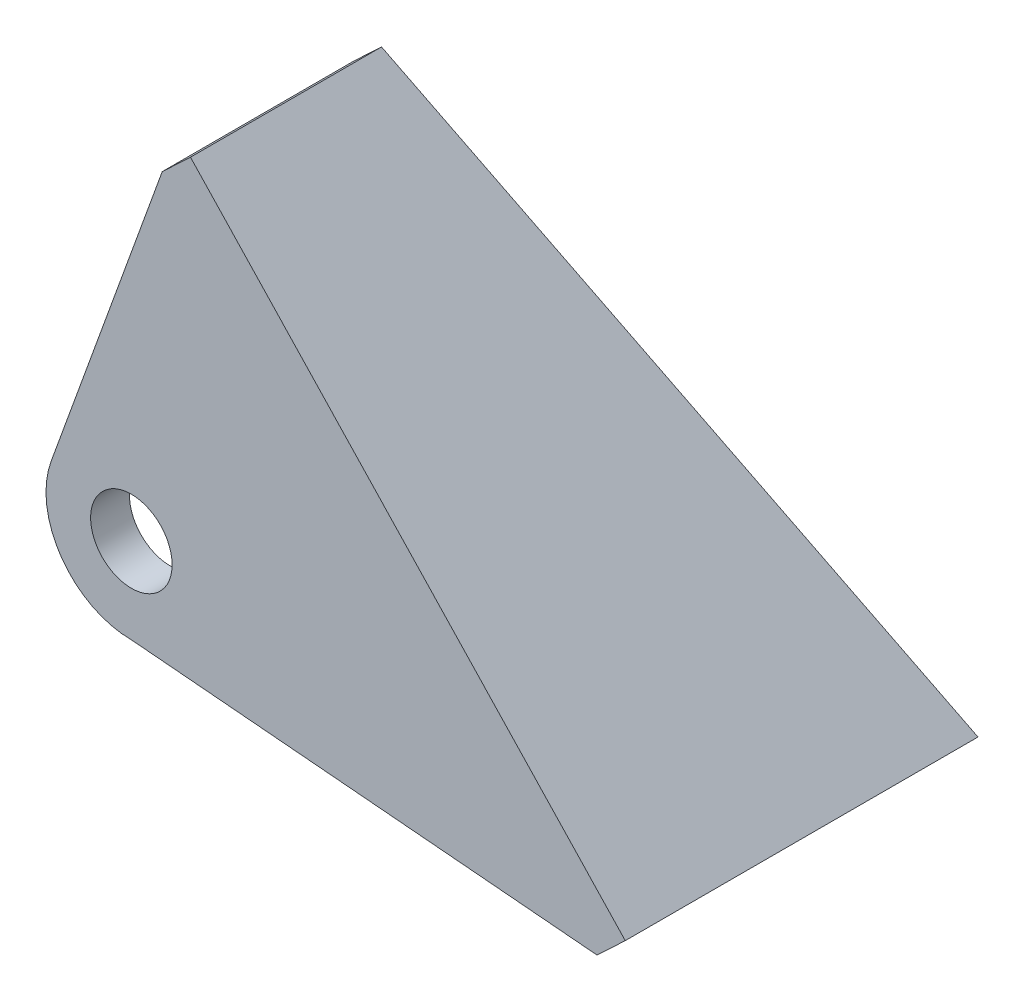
ISO-10303-21;
HEADER;
FILE_DESCRIPTION(('STEP AP214'),'2;1');
FILE_NAME('part.step','',(''),(''),'','','');
FILE_SCHEMA(('AUTOMOTIVE_DESIGN { 1 0 10303 214 1 1 1 1 }'));
ENDSEC;
DATA;
#1=APPLICATION_CONTEXT('core data for automotive mechanical design processes');
#2=APPLICATION_PROTOCOL_DEFINITION('international standard','automotive_design',2000,#1);
#3=PRODUCT_CONTEXT('',#1,'mechanical');
#4=PRODUCT('Part','Part','',(#3));
#5=PRODUCT_RELATED_PRODUCT_CATEGORY('part','',(#4));
#6=PRODUCT_DEFINITION_FORMATION('','',#4);
#7=PRODUCT_DEFINITION_CONTEXT('part definition',#1,'design');
#8=PRODUCT_DEFINITION('design','',#6,#7);
#9=PRODUCT_DEFINITION_SHAPE('','',#8);
#10=(LENGTH_UNIT() NAMED_UNIT(*) SI_UNIT(.MILLI.,.METRE.));
#11=(NAMED_UNIT(*) PLANE_ANGLE_UNIT() SI_UNIT($,.RADIAN.));
#12=(NAMED_UNIT(*) SI_UNIT($,.STERADIAN.) SOLID_ANGLE_UNIT());
#13=UNCERTAINTY_MEASURE_WITH_UNIT(LENGTH_MEASURE(1.E-05),#10,'distance_accuracy_value','');
#14=(GEOMETRIC_REPRESENTATION_CONTEXT(3) GLOBAL_UNCERTAINTY_ASSIGNED_CONTEXT((#13)) GLOBAL_UNIT_ASSIGNED_CONTEXT((#10,
#11,#12)) REPRESENTATION_CONTEXT('',''));
#15=CARTESIAN_POINT('',(0.,0.,0.));
#16=DIRECTION('',(0.,0.,1.));
#17=DIRECTION('',(1.,0.,0.));
#18=AXIS2_PLACEMENT_3D('',#15,#16,#17);
#19=CARTESIAN_POINT('',(-15.,-10.,-15.0000000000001));
#20=DIRECTION('',(0.,0.,1.));
#21=DIRECTION('',(1.,0.,0.));
#22=AXIS2_PLACEMENT_3D('',#19,#20,#21);
#23=PLANE('',#22);
#24=CARTESIAN_POINT('',(-15.,-10.,-15.0000000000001));
#25=DIRECTION('',(0.,0.,1.));
#26=DIRECTION('',(1.,0.,0.));
#27=AXIS2_PLACEMENT_3D('',#24,#25,#26);
#28=CIRCLE('',#27,11.);
#29=CARTESIAN_POINT('',(-25.3409426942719,-6.24967945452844,-15.0000000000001));
#30=VERTEX_POINT('',#29);
#31=CARTESIAN_POINT('',(-15.,-21.,-15.0000000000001));
#32=VERTEX_POINT('',#31);
#33=EDGE_CURVE('E78',#30,#32,#28,.T.);
#34=ORIENTED_EDGE('',*,*,#33,.T.);
#35=DIRECTION('',(0.996294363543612,-0.086008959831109,0.));
#36=VECTOR('',#35,1.);
#37=CARTESIAN_POINT('',(-15.,-21.,-15.0000000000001));
#38=LINE('',#37,#36);
#39=CARTESIAN_POINT('',(45.0000000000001,-26.1797317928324,-15.0000000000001));
#40=VERTEX_POINT('',#39);
#41=EDGE_CURVE('E142',#32,#40,#38,.T.);
#42=ORIENTED_EDGE('',*,*,#41,.T.);
#43=DIRECTION('',(-0.727571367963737,-0.686031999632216,0.));
#44=VECTOR('',#43,1.);
#45=CARTESIAN_POINT('',(48.6378568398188,-22.7495717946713,-15.0000000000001));
#46=LINE('',#45,#44);
#47=CARTESIAN_POINT('',(48.6378568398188,-22.7495717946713,-15.0000000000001));
#48=VERTEX_POINT('',#47);
#49=EDGE_CURVE('E114',#48,#40,#46,.T.);
#50=ORIENTED_EDGE('',*,*,#49,.F.);
#51=DIRECTION('',(0.686031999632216,-0.727571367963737,0.));
#52=VECTOR('',#51,1.);
#53=CARTESIAN_POINT('',(-7.38368013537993,36.6640799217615,-15.0000000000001));
#54=LINE('',#53,#52);
#55=CARTESIAN_POINT('',(-7.38368013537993,36.6640799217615,-15.0000000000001));
#56=VERTEX_POINT('',#55);
#57=EDGE_CURVE('E132',#56,#48,#54,.T.);
#58=ORIENTED_EDGE('',*,*,#57,.F.);
#59=DIRECTION('',(-0.727571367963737,-0.686031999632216,0.));
#60=VECTOR('',#59,1.);
#61=CARTESIAN_POINT('',(-7.38368013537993,36.6640799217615,-15.0000000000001));
#62=LINE('',#61,#60);
#63=CARTESIAN_POINT('',(-11.0215369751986,33.2339199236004,-15.0000000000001));
#64=VERTEX_POINT('',#63);
#65=EDGE_CURVE('E133',#56,#64,#62,.T.);
#66=ORIENTED_EDGE('',*,*,#65,.T.);
#67=DIRECTION('',(-0.340938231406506,-0.940085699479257,0.));
#68=VECTOR('',#67,1.);
#69=CARTESIAN_POINT('',(-25.3409426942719,-6.24967945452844,-15.0000000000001));
#70=LINE('',#69,#68);
#71=EDGE_CURVE('E48',#64,#30,#70,.T.);
#72=ORIENTED_EDGE('',*,*,#71,.T.);
#73=EDGE_LOOP('',(#34,#42,#50,#58,#66,#72));
#74=FACE_BOUND('',#73,.T.);
#75=CARTESIAN_POINT('',(-15.,-10.,-15.0000000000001));
#76=DIRECTION('',(0.,0.,1.));
#77=DIRECTION('',(1.,0.,0.));
#78=AXIS2_PLACEMENT_3D('',#75,#76,#77);
#79=CIRCLE('',#78,5.25);
#80=CARTESIAN_POINT('',(-9.75000000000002,-10.,-15.0000000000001));
#81=VERTEX_POINT('',#80);
#82=EDGE_CURVE('E90',#81,#81,#79,.T.);
#83=ORIENTED_EDGE('',*,*,#82,.F.);
#84=EDGE_LOOP('',(#83));
#85=FACE_BOUND('',#84,.T.);
#86=ADVANCED_FACE('F31',(#74,#85),#23,.T.);
#87=CARTESIAN_POINT('',(-15.,-10.,-20.0000000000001));
#88=DIRECTION('',(0.,0.,1.));
#89=DIRECTION('',(1.,0.,0.));
#90=AXIS2_PLACEMENT_3D('',#87,#88,#89);
#91=PLANE('',#90);
#92=CARTESIAN_POINT('',(-15.,-10.,-20.0000000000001));
#93=DIRECTION('',(0.,0.,1.));
#94=DIRECTION('',(1.,0.,0.));
#95=AXIS2_PLACEMENT_3D('',#92,#93,#94);
#96=CIRCLE('',#95,11.);
#97=CARTESIAN_POINT('',(-25.3409426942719,-6.24967945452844,-20.0000000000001));
#98=VERTEX_POINT('',#97);
#99=CARTESIAN_POINT('',(-15.,-21.,-20.0000000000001));
#100=VERTEX_POINT('',#99);
#101=EDGE_CURVE('E84',#98,#100,#96,.T.);
#102=ORIENTED_EDGE('',*,*,#101,.F.);
#103=DIRECTION('',(-0.340938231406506,-0.940085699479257,0.));
#104=VECTOR('',#103,1.);
#105=CARTESIAN_POINT('',(-25.3409426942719,-6.24967945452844,-20.0000000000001));
#106=LINE('',#105,#104);
#107=CARTESIAN_POINT('',(-11.0215369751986,33.2339199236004,-20.0000000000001));
#108=VERTEX_POINT('',#107);
#109=EDGE_CURVE('E69',#108,#98,#106,.T.);
#110=ORIENTED_EDGE('',*,*,#109,.F.);
#111=DIRECTION('',(-0.686031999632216,0.727571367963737,0.));
#112=VECTOR('',#111,1.);
#113=CARTESIAN_POINT('',(-11.0215369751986,33.2339199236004,-20.0000000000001));
#114=LINE('',#113,#112);
#115=CARTESIAN_POINT('',(45.0000000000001,-26.1797317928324,-20.0000000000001));
#116=VERTEX_POINT('',#115);
#117=EDGE_CURVE('E79',#116,#108,#114,.T.);
#118=ORIENTED_EDGE('',*,*,#117,.F.);
#119=DIRECTION('',(0.996294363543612,-0.086008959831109,0.));
#120=VECTOR('',#119,1.);
#121=CARTESIAN_POINT('',(-15.,-21.,-20.0000000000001));
#122=LINE('',#121,#120);
#123=EDGE_CURVE('E89',#100,#116,#122,.T.);
#124=ORIENTED_EDGE('',*,*,#123,.F.);
#125=EDGE_LOOP('',(#102,#110,#118,#124));
#126=FACE_BOUND('',#125,.T.);
#127=CARTESIAN_POINT('',(-15.,-10.,-20.0000000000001));
#128=DIRECTION('',(0.,0.,1.));
#129=DIRECTION('',(1.,0.,0.));
#130=AXIS2_PLACEMENT_3D('',#127,#128,#129);
#131=CIRCLE('',#130,5.25);
#132=CARTESIAN_POINT('',(-9.75000000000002,-10.,-20.0000000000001));
#133=VERTEX_POINT('',#132);
#134=EDGE_CURVE('E94',#133,#133,#131,.T.);
#135=ORIENTED_EDGE('',*,*,#134,.T.);
#136=EDGE_LOOP('',(#135));
#137=FACE_BOUND('',#136,.T.);
#138=ADVANCED_FACE('F86',(#126,#137),#91,.F.);
#139=CARTESIAN_POINT('',(-15.,-10.,-15.0000000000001));
#140=DIRECTION('',(0.,0.,-1.));
#141=DIRECTION('',(-1.,0.,0.));
#142=AXIS2_PLACEMENT_3D('',#139,#140,#141);
#143=CYLINDRICAL_SURFACE('',#142,11.);
#144=ORIENTED_EDGE('',*,*,#101,.T.);
#145=DIRECTION('',(0.,0.,-1.));
#146=VECTOR('',#145,1.);
#147=CARTESIAN_POINT('',(-15.,-21.,-15.0000000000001));
#148=LINE('',#147,#146);
#149=EDGE_CURVE('E11',#32,#100,#148,.T.);
#150=ORIENTED_EDGE('',*,*,#149,.F.);
#151=ORIENTED_EDGE('',*,*,#33,.F.);
#152=DIRECTION('',(0.,0.,-1.));
#153=VECTOR('',#152,1.);
#154=CARTESIAN_POINT('',(-25.3409426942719,-6.24967945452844,-15.0000000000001));
#155=LINE('',#154,#153);
#156=EDGE_CURVE('E72',#30,#98,#155,.T.);
#157=ORIENTED_EDGE('',*,*,#156,.T.);
#158=EDGE_LOOP('',(#144,#150,#151,#157));
#159=FACE_BOUND('',#158,.T.);
#160=ADVANCED_FACE('F33',(#159),#143,.T.);
#161=CARTESIAN_POINT('',(-15.,-21.,-15.0000000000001));
#162=DIRECTION('',(0.086008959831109,0.996294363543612,0.));
#163=DIRECTION('',(-0.996294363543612,0.086008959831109,0.));
#164=AXIS2_PLACEMENT_3D('',#161,#162,#163);
#165=PLANE('',#164);
#166=ORIENTED_EDGE('',*,*,#123,.T.);
#167=DIRECTION('',(0.,0.,-1.));
#168=VECTOR('',#167,1.);
#169=CARTESIAN_POINT('',(45.0000000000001,-26.1797317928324,-15.0000000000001));
#170=LINE('',#169,#168);
#171=EDGE_CURVE('E40',#40,#116,#170,.T.);
#172=ORIENTED_EDGE('',*,*,#171,.F.);
#173=ORIENTED_EDGE('',*,*,#41,.F.);
#174=ORIENTED_EDGE('',*,*,#149,.T.);
#175=EDGE_LOOP('',(#166,#172,#173,#174));
#176=FACE_BOUND('',#175,.T.);
#177=ADVANCED_FACE('F118',(#176),#165,.F.);
#178=CARTESIAN_POINT('',(-25.3409426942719,-6.24967945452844,-15.0000000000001));
#179=DIRECTION('',(0.940085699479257,-0.340938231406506,0.));
#180=DIRECTION('',(0.340938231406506,0.940085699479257,0.));
#181=AXIS2_PLACEMENT_3D('',#178,#179,#180);
#182=PLANE('',#181);
#183=ORIENTED_EDGE('',*,*,#109,.T.);
#184=ORIENTED_EDGE('',*,*,#156,.F.);
#185=ORIENTED_EDGE('',*,*,#71,.F.);
#186=DIRECTION('',(0.,0.,-1.));
#187=VECTOR('',#186,1.);
#188=CARTESIAN_POINT('',(-11.0215369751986,33.2339199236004,-15.0000000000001));
#189=LINE('',#188,#187);
#190=EDGE_CURVE('E74',#64,#108,#189,.T.);
#191=ORIENTED_EDGE('',*,*,#190,.T.);
#192=EDGE_LOOP('',(#183,#184,#185,#191));
#193=FACE_BOUND('',#192,.T.);
#194=ADVANCED_FACE('F71',(#193),#182,.F.);
#195=CARTESIAN_POINT('',(-15.,-10.,-15.0000000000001));
#196=DIRECTION('',(0.,0.,-1.));
#197=DIRECTION('',(-1.,0.,0.));
#198=AXIS2_PLACEMENT_3D('',#195,#196,#197);
#199=CYLINDRICAL_SURFACE('',#198,5.25);
#200=ORIENTED_EDGE('',*,*,#82,.T.);
#201=EDGE_LOOP('',(#200));
#202=FACE_BOUND('',#201,.T.);
#203=ORIENTED_EDGE('',*,*,#134,.F.);
#204=EDGE_LOOP('',(#203));
#205=FACE_BOUND('',#204,.T.);
#206=ADVANCED_FACE('F191',(#202,#205),#199,.F.);
#207=CARTESIAN_POINT('',(45.0000000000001,-26.1797317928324,-15.0000000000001));
#208=DIRECTION('',(0.727571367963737,0.686031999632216,0.));
#209=DIRECTION('',(-0.686031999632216,0.727571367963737,0.));
#210=AXIS2_PLACEMENT_3D('',#207,#208,#209);
#211=PLANE('',#210);
#212=DIRECTION('',(0.,0.,-1.));
#213=VECTOR('',#212,1.);
#214=CARTESIAN_POINT('',(45.0000000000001,-26.1797317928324,-15.0000000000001));
#215=LINE('',#214,#213);
#216=CARTESIAN_POINT('',(45.0000000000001,-26.1797317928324,-60.4479558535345));
#217=VERTEX_POINT('',#216);
#218=EDGE_CURVE('E109',#116,#217,#215,.T.);
#219=ORIENTED_EDGE('',*,*,#218,.F.);
#220=ORIENTED_EDGE('',*,*,#117,.T.);
#221=DIRECTION('',(0.,0.,1.));
#222=VECTOR('',#221,1.);
#223=CARTESIAN_POINT('',(-11.0215369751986,33.2339199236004,-15.0000000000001));
#224=LINE('',#223,#222);
#225=CARTESIAN_POINT('',(-11.0215369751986,33.2339199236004,-39.6116870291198));
#226=VERTEX_POINT('',#225);
#227=EDGE_CURVE('E63',#226,#108,#224,.T.);
#228=ORIENTED_EDGE('',*,*,#227,.F.);
#229=DIRECTION('',(-0.664734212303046,0.704983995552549,0.247236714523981));
#230=VECTOR('',#229,1.);
#231=CARTESIAN_POINT('',(45.0000000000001,-26.1797317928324,-60.4479558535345));
#232=LINE('',#231,#230);
#233=EDGE_CURVE('E124',#217,#226,#232,.T.);
#234=ORIENTED_EDGE('',*,*,#233,.F.);
#235=EDGE_LOOP('',(#219,#220,#228,#234));
#236=FACE_BOUND('',#235,.T.);
#237=ADVANCED_FACE('F120',(#236),#211,.F.);
#238=CARTESIAN_POINT('',(48.6378568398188,-22.7495717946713,-15.0000000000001));
#239=DIRECTION('',(-0.686031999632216,0.727571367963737,0.));
#240=DIRECTION('',(-0.727571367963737,-0.686031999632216,0.));
#241=AXIS2_PLACEMENT_3D('',#238,#239,#240);
#242=PLANE('',#241);
#243=ORIENTED_EDGE('',*,*,#171,.T.);
#244=ORIENTED_EDGE('',*,*,#218,.T.);
#245=DIRECTION('',(-0.727571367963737,-0.686031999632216,0.));
#246=VECTOR('',#245,1.);
#247=CARTESIAN_POINT('',(48.6378568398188,-22.7495717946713,-60.4479558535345));
#248=LINE('',#247,#246);
#249=CARTESIAN_POINT('',(48.6378568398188,-22.7495717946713,-60.4479558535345));
#250=VERTEX_POINT('',#249);
#251=EDGE_CURVE('E137',#250,#217,#248,.T.);
#252=ORIENTED_EDGE('',*,*,#251,.F.);
#253=DIRECTION('',(0.,0.,-1.));
#254=VECTOR('',#253,1.);
#255=CARTESIAN_POINT('',(48.6378568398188,-22.7495717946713,-15.0000000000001));
#256=LINE('',#255,#254);
#257=EDGE_CURVE('E157',#48,#250,#256,.T.);
#258=ORIENTED_EDGE('',*,*,#257,.F.);
#259=ORIENTED_EDGE('',*,*,#49,.T.);
#260=EDGE_LOOP('',(#243,#244,#252,#258,#259));
#261=FACE_BOUND('',#260,.T.);
#262=ADVANCED_FACE('F105',(#261),#242,.F.);
#263=CARTESIAN_POINT('',(48.6378568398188,-22.7495717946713,-60.4479558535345));
#264=DIRECTION('',(0.169612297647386,-0.179882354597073,0.968955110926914));
#265=DIRECTION('',(0.,-0.983200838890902,-0.182527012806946));
#266=AXIS2_PLACEMENT_3D('',#263,#264,#265);
#267=PLANE('',#266);
#268=ORIENTED_EDGE('',*,*,#233,.T.);
#269=DIRECTION('',(-0.727571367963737,-0.686031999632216,0.));
#270=VECTOR('',#269,1.);
#271=CARTESIAN_POINT('',(-7.38368013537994,36.6640799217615,-39.6116870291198));
#272=LINE('',#271,#270);
#273=CARTESIAN_POINT('',(-7.38368013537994,36.6640799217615,-39.6116870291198));
#274=VERTEX_POINT('',#273);
#275=EDGE_CURVE('E135',#274,#226,#272,.T.);
#276=ORIENTED_EDGE('',*,*,#275,.F.);
#277=DIRECTION('',(-0.664734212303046,0.704983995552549,0.247236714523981));
#278=VECTOR('',#277,1.);
#279=CARTESIAN_POINT('',(48.6378568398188,-22.7495717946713,-60.4479558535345));
#280=LINE('',#279,#278);
#281=EDGE_CURVE('E165',#250,#274,#280,.T.);
#282=ORIENTED_EDGE('',*,*,#281,.F.);
#283=ORIENTED_EDGE('',*,*,#251,.T.);
#284=EDGE_LOOP('',(#268,#276,#282,#283));
#285=FACE_BOUND('',#284,.T.);
#286=ADVANCED_FACE('F173',(#285),#267,.F.);
#287=CARTESIAN_POINT('',(-7.38368013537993,36.6640799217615,-15.0000000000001));
#288=DIRECTION('',(0.686031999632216,-0.727571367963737,0.));
#289=DIRECTION('',(0.727571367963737,0.686031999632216,0.));
#290=AXIS2_PLACEMENT_3D('',#287,#288,#289);
#291=PLANE('',#290);
#292=ORIENTED_EDGE('',*,*,#227,.T.);
#293=ORIENTED_EDGE('',*,*,#190,.F.);
#294=ORIENTED_EDGE('',*,*,#65,.F.);
#295=DIRECTION('',(0.,0.,1.));
#296=VECTOR('',#295,1.);
#297=CARTESIAN_POINT('',(-7.38368013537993,36.6640799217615,-15.0000000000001));
#298=LINE('',#297,#296);
#299=EDGE_CURVE('E128',#274,#56,#298,.T.);
#300=ORIENTED_EDGE('',*,*,#299,.F.);
#301=ORIENTED_EDGE('',*,*,#275,.T.);
#302=EDGE_LOOP('',(#292,#293,#294,#300,#301));
#303=FACE_BOUND('',#302,.T.);
#304=ADVANCED_FACE('F169',(#303),#291,.F.);
#305=CARTESIAN_POINT('',(48.6378568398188,-22.7495717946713,-15.0000000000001));
#306=DIRECTION('',(0.727571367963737,0.686031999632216,0.));
#307=DIRECTION('',(-0.686031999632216,0.727571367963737,0.));
#308=AXIS2_PLACEMENT_3D('',#305,#306,#307);
#309=PLANE('',#308);
#310=ORIENTED_EDGE('',*,*,#57,.T.);
#311=ORIENTED_EDGE('',*,*,#257,.T.);
#312=ORIENTED_EDGE('',*,*,#281,.T.);
#313=ORIENTED_EDGE('',*,*,#299,.T.);
#314=EDGE_LOOP('',(#310,#311,#312,#313));
#315=FACE_BOUND('',#314,.T.);
#316=ADVANCED_FACE('F168',(#315),#309,.T.);
#317=CLOSED_SHELL('',(#86,#138,#160,#177,#194,#206,#237,#262,#286,#304,#316));
#318=MANIFOLD_SOLID_BREP('B2',#317);
#319=ADVANCED_BREP_SHAPE_REPRESENTATION('',(#18,#318),#14);
#320=SHAPE_DEFINITION_REPRESENTATION(#9,#319);
ENDSEC;
END-ISO-10303-21;
